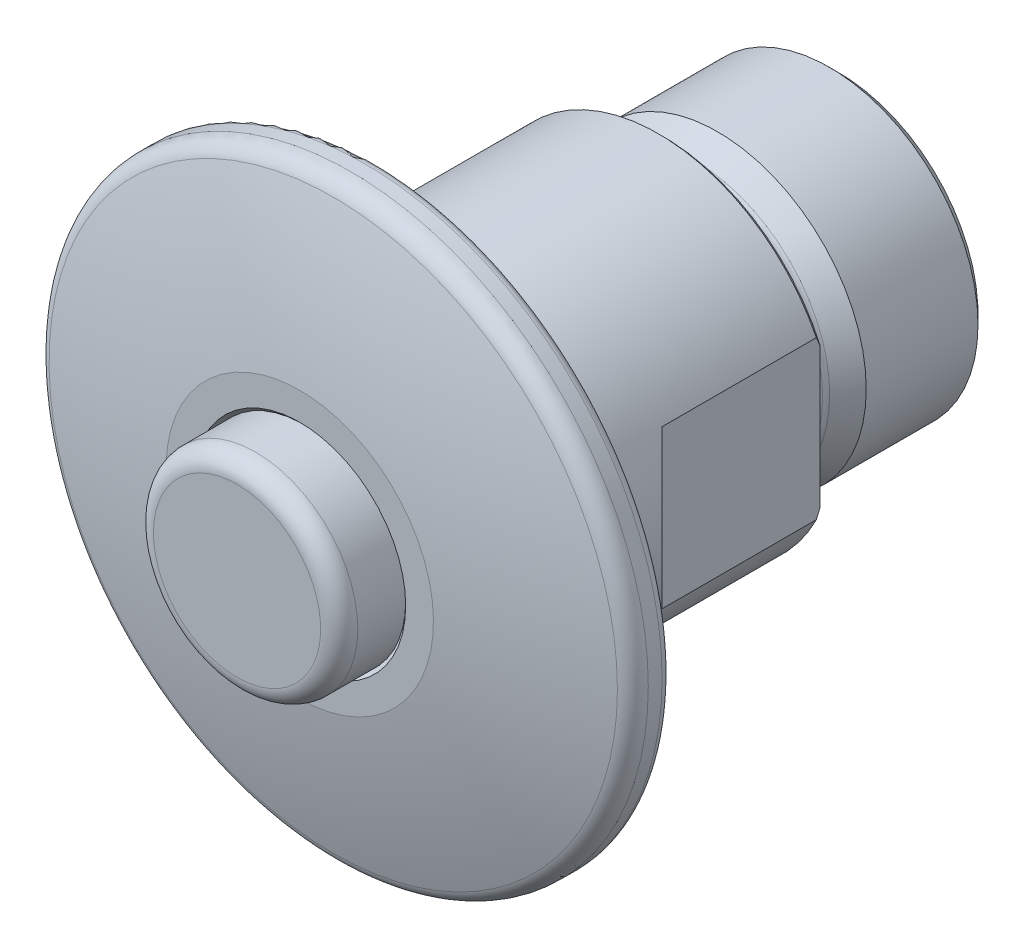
ISO-10303-21;
HEADER;
FILE_DESCRIPTION(('STEP AP214'),'2;1');
FILE_NAME('part.step','',(''),(''),'','','');
FILE_SCHEMA(('AUTOMOTIVE_DESIGN { 1 0 10303 214 1 1 1 1 }'));
ENDSEC;
DATA;
#1=APPLICATION_CONTEXT('core data for automotive mechanical design processes');
#2=APPLICATION_PROTOCOL_DEFINITION('international standard','automotive_design',2000,#1);
#3=PRODUCT_CONTEXT('',#1,'mechanical');
#4=PRODUCT('Part','Part','',(#3));
#5=PRODUCT_RELATED_PRODUCT_CATEGORY('part','',(#4));
#6=PRODUCT_DEFINITION_FORMATION('','',#4);
#7=PRODUCT_DEFINITION_CONTEXT('part definition',#1,'design');
#8=PRODUCT_DEFINITION('design','',#6,#7);
#9=PRODUCT_DEFINITION_SHAPE('','',#8);
#10=(LENGTH_UNIT() NAMED_UNIT(*) SI_UNIT(.MILLI.,.METRE.));
#11=(NAMED_UNIT(*) PLANE_ANGLE_UNIT() SI_UNIT($,.RADIAN.));
#12=(NAMED_UNIT(*) SI_UNIT($,.STERADIAN.) SOLID_ANGLE_UNIT());
#13=UNCERTAINTY_MEASURE_WITH_UNIT(LENGTH_MEASURE(1.E-05),#10,'distance_accuracy_value','');
#14=(GEOMETRIC_REPRESENTATION_CONTEXT(3) GLOBAL_UNCERTAINTY_ASSIGNED_CONTEXT((#13)) GLOBAL_UNIT_ASSIGNED_CONTEXT((#10,
#11,#12)) REPRESENTATION_CONTEXT('',''));
#15=CARTESIAN_POINT('',(0.,0.,0.));
#16=DIRECTION('',(0.,0.,1.));
#17=DIRECTION('',(1.,0.,0.));
#18=AXIS2_PLACEMENT_3D('',#15,#16,#17);
#19=CARTESIAN_POINT('',(0.,0.,0.2));
#20=DIRECTION('',(0.,0.,1.));
#21=DIRECTION('',(-1.,0.,0.));
#22=AXIS2_PLACEMENT_3D('',#19,#20,#21);
#23=CONICAL_SURFACE('',#22,9.5,0.785398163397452);
#24=CARTESIAN_POINT('',(8.5,-19.0943646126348,11.6008315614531));
#25=CARTESIAN_POINT('',(8.5,-18.8138735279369,11.3445887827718));
#26=CARTESIAN_POINT('',(8.5,-18.5329229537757,11.0888486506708));
#27=CARTESIAN_POINT('',(8.5,-17.9699706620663,10.5785232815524));
#28=CARTESIAN_POINT('',(8.5,-17.6879689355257,10.3239380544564));
#29=CARTESIAN_POINT('',(8.5,-16.8400586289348,9.56202227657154));
#30=CARTESIAN_POINT('',(8.5,-16.2723811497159,9.05665634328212));
#31=CARTESIAN_POINT('',(8.5,-15.12687872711,8.04927472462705));
#32=CARTESIAN_POINT('',(8.5,-14.5490103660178,7.54730823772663));
#33=CARTESIAN_POINT('',(8.5,-13.6760664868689,6.8016176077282));
#34=CARTESIAN_POINT('',(8.5,-13.3840789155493,6.55427818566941));
#35=CARTESIAN_POINT('',(8.5,-12.7976953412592,6.06246897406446));
#36=CARTESIAN_POINT('',(8.5,-12.5032993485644,5.81799917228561));
#37=CARTESIAN_POINT('',(8.5,-11.9575818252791,5.37015304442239));
#38=CARTESIAN_POINT('',(8.5,-11.7066635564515,5.16628561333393));
#39=CARTESIAN_POINT('',(8.5,-11.2025163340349,4.76142938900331));
#40=CARTESIAN_POINT('',(8.5,-10.9492874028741,4.56044056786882));
#41=CARTESIAN_POINT('',(8.5,-10.4400806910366,4.1618043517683));
#42=CARTESIAN_POINT('',(8.5,-10.184102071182,3.96415802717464));
#43=CARTESIAN_POINT('',(8.5,-9.66905078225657,3.57293588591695));
#44=CARTESIAN_POINT('',(8.5,-9.40997814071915,3.37936003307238));
#45=CARTESIAN_POINT('',(8.5,-8.88858958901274,2.99738076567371));
#46=CARTESIAN_POINT('',(8.5,-8.62627866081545,2.80897056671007));
#47=CARTESIAN_POINT('',(8.5,-8.09744880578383,2.4381059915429));
#48=CARTESIAN_POINT('',(8.5,-7.83092968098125,2.25565189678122));
#49=CARTESIAN_POINT('',(8.5,-7.29312649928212,1.898184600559));
#50=CARTESIAN_POINT('',(8.5,-7.02184496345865,1.72316762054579));
#51=CARTESIAN_POINT('',(8.5,-6.47360674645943,1.38229751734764));
#52=CARTESIAN_POINT('',(8.5,-6.19665085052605,1.21644313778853));
#53=CARTESIAN_POINT('',(8.5,-5.64264106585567,0.899946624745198));
#54=CARTESIAN_POINT('',(8.5,-5.36573881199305,0.749040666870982));
#55=CARTESIAN_POINT('',(8.5,-4.80475306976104,0.46103013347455));
#56=CARTESIAN_POINT('',(8.5,-4.52066889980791,0.323926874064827));
#57=CARTESIAN_POINT('',(8.5,-3.94506856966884,0.0673529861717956));
#58=CARTESIAN_POINT('',(8.5,-3.65356393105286,-0.0521432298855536));
#59=CARTESIAN_POINT('',(8.5,-3.06248782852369,-0.269307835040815));
#60=CARTESIAN_POINT('',(8.5,-2.76291865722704,-0.366982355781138));
#61=CARTESIAN_POINT('',(8.5,-2.21511843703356,-0.519247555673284));
#62=CARTESIAN_POINT('',(8.5,-1.96819636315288,-0.578519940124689));
#63=CARTESIAN_POINT('',(8.5,-1.47038918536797,-0.677205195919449));
#64=CARTESIAN_POINT('',(8.5,-1.21950464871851,-0.716620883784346));
#65=CARTESIAN_POINT('',(8.5,-0.715807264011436,-0.77357398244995));
#66=CARTESIAN_POINT('',(8.5,-0.463000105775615,-0.791160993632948));
#67=CARTESIAN_POINT('',(8.5,0.0431832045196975,-0.803656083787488));
#68=CARTESIAN_POINT('',(8.5,0.296559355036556,-0.798564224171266));
#69=CARTESIAN_POINT('',(8.5,0.801483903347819,-0.766010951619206));
#70=CARTESIAN_POINT('',(8.5,1.05303439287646,-0.738581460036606));
#71=CARTESIAN_POINT('',(8.5,1.55294571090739,-0.66283917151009));
#72=CARTESIAN_POINT('',(8.5,1.80130626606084,-0.614524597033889));
#73=CARTESIAN_POINT('',(8.5,2.29429637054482,-0.499081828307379));
#74=CARTESIAN_POINT('',(8.5,2.53891347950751,-0.431901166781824));
#75=CARTESIAN_POINT('',(8.5,3.02304633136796,-0.281360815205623));
#76=CARTESIAN_POINT('',(8.5,3.26256224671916,-0.198001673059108));
#77=CARTESIAN_POINT('',(8.5,3.80850002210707,0.00983052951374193));
#78=CARTESIAN_POINT('',(8.5,4.11308980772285,0.139094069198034));
#79=CARTESIAN_POINT('',(8.5,4.71389361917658,0.415947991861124));
#80=CARTESIAN_POINT('',(8.5,5.01010313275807,0.56354802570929));
#81=CARTESIAN_POINT('',(8.5,5.59547300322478,0.873374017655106));
#82=CARTESIAN_POINT('',(8.5,5.88461804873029,1.03562868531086));
#83=CARTESIAN_POINT('',(8.5,6.45618128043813,1.37140175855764));
#84=CARTESIAN_POINT('',(8.5,6.7386005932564,1.54491825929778));
#85=CARTESIAN_POINT('',(8.5,7.30080558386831,1.90286894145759));
#86=CARTESIAN_POINT('',(8.5,7.58052760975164,2.08740262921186));
#87=CARTESIAN_POINT('',(8.5,8.13499642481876,2.46378947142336));
#88=CARTESIAN_POINT('',(8.5,8.40974305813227,2.65564285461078));
#89=CARTESIAN_POINT('',(8.5,8.95467932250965,3.04503953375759));
#90=CARTESIAN_POINT('',(8.5,9.22487388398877,3.24257594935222));
#91=CARTESIAN_POINT('',(8.5,9.76166130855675,3.64248866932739));
#92=CARTESIAN_POINT('',(8.5,10.0282540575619,3.84486512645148));
#93=CARTESIAN_POINT('',(8.5,10.6829535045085,4.34968180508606));
#94=CARTESIAN_POINT('',(8.5,11.0692715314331,4.65444012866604));
#95=CARTESIAN_POINT('',(8.5,11.8365740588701,5.27059733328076));
#96=CARTESIAN_POINT('',(8.5,12.2175583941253,5.58199641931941));
#97=CARTESIAN_POINT('',(8.5,12.9753822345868,6.2101778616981));
#98=CARTESIAN_POINT('',(8.5,13.352219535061,6.52696287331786));
#99=CARTESIAN_POINT('',(8.5,14.1023361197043,7.16471757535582));
#100=CARTESIAN_POINT('',(8.5,14.4756153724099,7.48568730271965));
#101=CARTESIAN_POINT('',(8.5,15.2059478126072,8.11950452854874));
#102=CARTESIAN_POINT('',(8.5,15.5631045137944,8.43223289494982));
#103=CARTESIAN_POINT('',(8.5,16.2751075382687,9.06031130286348));
#104=CARTESIAN_POINT('',(8.5,16.6299538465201,9.37566136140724));
#105=CARTESIAN_POINT('',(8.5,17.3373573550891,10.0082593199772));
#106=CARTESIAN_POINT('',(8.5,17.6899163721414,10.3255051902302));
#107=CARTESIAN_POINT('',(8.5,18.3933408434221,10.9618543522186));
#108=CARTESIAN_POINT('',(8.5,18.7442063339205,11.2809576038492));
#109=CARTESIAN_POINT('',(8.5,19.0943646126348,11.6008315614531));
#110=B_SPLINE_CURVE_WITH_KNOTS('',3,(#24,#25,#26,#27,#28,#29,#30,#31,#32,#33,#34,#35,#36,#37,
#38,#39,#40,#41,#42,#43,#44,#45,#46,#47,#48,#49,#50,#51,#52,#53,#54,#55,#56,#57,#58,#59,#60,#61,
#62,#63,#64,#65,#66,#67,#68,#69,#70,#71,#72,#73,#74,#75,#76,#77,#78,#79,#80,#81,#82,#83,#84,#85,
#86,#87,#88,#89,#90,#91,#92,#93,#94,#95,#96,#97,#98,#99,#100,#101,#102,#103,#104,#105,#106,#107,
#108,#109),.UNSPECIFIED.,.F.,.F.,(4,2,2,2,2,2,2,2,2,2,2,2,2,2,2,2,2,2,2,2,2,2,2,2,2,2,2,2,2,2,2,
2,2,2,2,2,2,2,2,2,2,2,4),(0.,1.13974518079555,2.27950013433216,4.55956410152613,
6.85580270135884,8.00378756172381,9.1517675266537,10.1216454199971,11.0915139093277,
12.061687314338,13.0318520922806,14.0006748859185,14.969543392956,15.937913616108,
16.9061507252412,17.8519028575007,18.7977450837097,19.7421989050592,20.686387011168,
21.4474901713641,22.2084853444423,22.9677481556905,23.7270089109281,24.4851865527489,
25.2434287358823,26.0038008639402,26.7641472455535,27.75598981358,28.748356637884,
29.7427115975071,30.7368988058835,31.7420791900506,32.7472910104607,33.7513331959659,
34.7554071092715,36.231472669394,37.7075838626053,39.1844451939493,40.661319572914,
42.0854672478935,43.5096241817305,44.9324612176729,46.3552676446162),.UNSPECIFIED.);
#111=CARTESIAN_POINT('',(8.5,-4.24264068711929,0.2));
#112=VERTEX_POINT('',#111);
#113=CARTESIAN_POINT('',(8.5,-3.77359245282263,0.));
#114=VERTEX_POINT('',#113);
#115=EDGE_CURVE('E66',#112,#114,#110,.T.);
#116=ORIENTED_EDGE('',*,*,#115,.F.);
#117=CARTESIAN_POINT('',(0.,0.,0.2));
#118=DIRECTION('',(0.,0.,1.));
#119=DIRECTION('',(-1.,0.,0.));
#120=AXIS2_PLACEMENT_3D('',#117,#118,#119);
#121=CIRCLE('',#120,9.5);
#122=CARTESIAN_POINT('',(-8.5,-4.24264068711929,0.2));
#123=VERTEX_POINT('',#122);
#124=EDGE_CURVE('E86',#123,#112,#121,.T.);
#125=ORIENTED_EDGE('',*,*,#124,.F.);
#126=CARTESIAN_POINT('',(-8.5,19.0943646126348,11.6008315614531));
#127=CARTESIAN_POINT('',(-8.5,18.8138735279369,11.3445887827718));
#128=CARTESIAN_POINT('',(-8.5,18.5329229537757,11.0888486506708));
#129=CARTESIAN_POINT('',(-8.5,17.9699706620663,10.5785232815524));
#130=CARTESIAN_POINT('',(-8.5,17.6879689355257,10.3239380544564));
#131=CARTESIAN_POINT('',(-8.5,16.8400586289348,9.56202227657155));
#132=CARTESIAN_POINT('',(-8.5,16.2723811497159,9.05665634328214));
#133=CARTESIAN_POINT('',(-8.5,15.12687872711,8.04927472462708));
#134=CARTESIAN_POINT('',(-8.5,14.5490103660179,7.54730823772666));
#135=CARTESIAN_POINT('',(-8.5,13.676066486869,6.80161760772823));
#136=CARTESIAN_POINT('',(-8.5,13.3840789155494,6.55427818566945));
#137=CARTESIAN_POINT('',(-8.5,12.7976953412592,6.0624689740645));
#138=CARTESIAN_POINT('',(-8.5,12.5032993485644,5.81799917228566));
#139=CARTESIAN_POINT('',(-8.5,11.9575818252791,5.37015304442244));
#140=CARTESIAN_POINT('',(-8.5,11.7066635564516,5.16628561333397));
#141=CARTESIAN_POINT('',(-8.5,11.202516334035,4.76142938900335));
#142=CARTESIAN_POINT('',(-8.5,10.9492874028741,4.56044056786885));
#143=CARTESIAN_POINT('',(-8.5,10.4400806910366,4.16180435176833));
#144=CARTESIAN_POINT('',(-8.5,10.184102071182,3.96415802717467));
#145=CARTESIAN_POINT('',(-8.5,9.66905078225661,3.57293588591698));
#146=CARTESIAN_POINT('',(-8.5,9.40997814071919,3.37936003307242));
#147=CARTESIAN_POINT('',(-8.5,8.88858958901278,2.99738076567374));
#148=CARTESIAN_POINT('',(-8.5,8.6262786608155,2.80897056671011));
#149=CARTESIAN_POINT('',(-8.5,8.09744880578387,2.43810599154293));
#150=CARTESIAN_POINT('',(-8.5,7.8309296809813,2.25565189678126));
#151=CARTESIAN_POINT('',(-8.5,7.29312649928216,1.89818460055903));
#152=CARTESIAN_POINT('',(-8.5,7.0218449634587,1.72316762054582));
#153=CARTESIAN_POINT('',(-8.5,6.47360674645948,1.38229751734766));
#154=CARTESIAN_POINT('',(-8.5,6.1966508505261,1.21644313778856));
#155=CARTESIAN_POINT('',(-8.5,5.64264106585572,0.899946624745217));
#156=CARTESIAN_POINT('',(-8.5,5.3657388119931,0.749040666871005));
#157=CARTESIAN_POINT('',(-8.5,4.80475306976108,0.461030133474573));
#158=CARTESIAN_POINT('',(-8.5,4.52066889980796,0.323926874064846));
#159=CARTESIAN_POINT('',(-8.5,3.94506856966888,0.0673529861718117));
#160=CARTESIAN_POINT('',(-8.5,3.6535639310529,-0.052143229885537));
#161=CARTESIAN_POINT('',(-8.5,3.06248782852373,-0.2693078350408));
#162=CARTESIAN_POINT('',(-8.5,2.76291865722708,-0.366982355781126));
#163=CARTESIAN_POINT('',(-8.5,2.2151184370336,-0.519247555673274));
#164=CARTESIAN_POINT('',(-8.5,1.96819636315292,-0.578519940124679));
#165=CARTESIAN_POINT('',(-8.5,1.47038918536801,-0.677205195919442));
#166=CARTESIAN_POINT('',(-8.5,1.21950464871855,-0.716620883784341));
#167=CARTESIAN_POINT('',(-8.5,0.71580726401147,-0.773573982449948));
#168=CARTESIAN_POINT('',(-8.5,0.463000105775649,-0.791160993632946));
#169=CARTESIAN_POINT('',(-8.5,-0.0431832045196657,-0.803656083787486));
#170=CARTESIAN_POINT('',(-8.5,-0.296559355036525,-0.798564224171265));
#171=CARTESIAN_POINT('',(-8.5,-0.801483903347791,-0.766010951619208));
#172=CARTESIAN_POINT('',(-8.5,-1.05303439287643,-0.73858146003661));
#173=CARTESIAN_POINT('',(-8.5,-1.55294571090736,-0.662839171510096));
#174=CARTESIAN_POINT('',(-8.5,-1.80130626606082,-0.614524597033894));
#175=CARTESIAN_POINT('',(-8.5,-2.29429637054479,-0.499081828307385));
#176=CARTESIAN_POINT('',(-8.5,-2.53891347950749,-0.431901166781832));
#177=CARTESIAN_POINT('',(-8.5,-3.02304633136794,-0.281360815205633));
#178=CARTESIAN_POINT('',(-8.5,-3.26256224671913,-0.198001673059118));
#179=CARTESIAN_POINT('',(-8.5,-3.80850002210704,0.00983052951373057));
#180=CARTESIAN_POINT('',(-8.5,-4.11308980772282,0.139094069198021));
#181=CARTESIAN_POINT('',(-8.5,-4.71389361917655,0.415947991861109));
#182=CARTESIAN_POINT('',(-8.5,-5.01010313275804,0.563548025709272));
#183=CARTESIAN_POINT('',(-8.5,-5.59547300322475,0.873374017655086));
#184=CARTESIAN_POINT('',(-8.5,-5.88461804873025,1.03562868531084));
#185=CARTESIAN_POINT('',(-8.5,-6.45618128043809,1.37140175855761));
#186=CARTESIAN_POINT('',(-8.5,-6.73860059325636,1.54491825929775));
#187=CARTESIAN_POINT('',(-8.5,-7.30080558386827,1.90286894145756));
#188=CARTESIAN_POINT('',(-8.5,-7.58052760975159,2.08740262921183));
#189=CARTESIAN_POINT('',(-8.5,-8.13499642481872,2.46378947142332));
#190=CARTESIAN_POINT('',(-8.5,-8.40974305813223,2.65564285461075));
#191=CARTESIAN_POINT('',(-8.5,-8.95467932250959,3.04503953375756));
#192=CARTESIAN_POINT('',(-8.5,-9.22487388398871,3.24257594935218));
#193=CARTESIAN_POINT('',(-8.5,-9.7616613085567,3.64248866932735));
#194=CARTESIAN_POINT('',(-8.5,-10.0282540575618,3.84486512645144));
#195=CARTESIAN_POINT('',(-8.5,-10.6829535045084,4.34968180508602));
#196=CARTESIAN_POINT('',(-8.5,-11.0692715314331,4.654440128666));
#197=CARTESIAN_POINT('',(-8.5,-11.83657405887,5.27059733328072));
#198=CARTESIAN_POINT('',(-8.5,-12.2175583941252,5.58199641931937));
#199=CARTESIAN_POINT('',(-8.5,-12.9753822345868,6.21017786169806));
#200=CARTESIAN_POINT('',(-8.5,-13.352219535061,6.52696287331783));
#201=CARTESIAN_POINT('',(-8.5,-14.1023361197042,7.16471757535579));
#202=CARTESIAN_POINT('',(-8.5,-14.4756153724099,7.48568730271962));
#203=CARTESIAN_POINT('',(-8.5,-15.2059478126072,8.11950452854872));
#204=CARTESIAN_POINT('',(-8.5,-15.5631045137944,8.4322328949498));
#205=CARTESIAN_POINT('',(-8.5,-16.2751075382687,9.06031130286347));
#206=CARTESIAN_POINT('',(-8.5,-16.6299538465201,9.37566136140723));
#207=CARTESIAN_POINT('',(-8.5,-17.3373573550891,10.0082593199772));
#208=CARTESIAN_POINT('',(-8.5,-17.6899163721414,10.3255051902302));
#209=CARTESIAN_POINT('',(-8.5,-18.3933408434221,10.9618543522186));
#210=CARTESIAN_POINT('',(-8.5,-18.7442063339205,11.2809576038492));
#211=CARTESIAN_POINT('',(-8.5,-19.0943646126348,11.6008315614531));
#212=B_SPLINE_CURVE_WITH_KNOTS('',3,(#126,#127,#128,#129,#130,#131,#132,#133,#134,#135,#136,
#137,#138,#139,#140,#141,#142,#143,#144,#145,#146,#147,#148,#149,#150,#151,#152,#153,#154,#155,
#156,#157,#158,#159,#160,#161,#162,#163,#164,#165,#166,#167,#168,#169,#170,#171,#172,#173,#174,
#175,#176,#177,#178,#179,#180,#181,#182,#183,#184,#185,#186,#187,#188,#189,#190,#191,#192,#193,
#194,#195,#196,#197,#198,#199,#200,#201,#202,#203,#204,#205,#206,#207,#208,#209,#210,#211),
.UNSPECIFIED.,.F.,.F.,(4,2,2,2,2,2,2,2,2,2,2,2,2,2,2,2,2,2,2,2,2,2,2,2,2,2,2,2,2,2,2,2,2,2,2,2,
2,2,2,2,2,2,4),(0.,1.13974518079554,2.27950013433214,4.55956410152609,6.85580270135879,
8.00378756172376,9.15176752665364,10.121645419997,11.0915139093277,12.0616873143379,
13.0318520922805,14.0006748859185,14.9695433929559,15.9379136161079,16.9061507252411,
17.8519028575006,18.7977450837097,19.7421989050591,20.686387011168,21.4474901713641,
22.2084853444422,22.9677481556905,23.7270089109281,24.4851865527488,25.2434287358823,
26.0038008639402,26.7641472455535,27.75598981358,28.7483566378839,29.7427115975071,
30.7368988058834,31.7420791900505,32.7472910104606,33.7513331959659,34.7554071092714,
36.2314726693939,37.7075838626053,39.1844451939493,40.6613195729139,42.0854672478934,
43.5096241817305,44.9324612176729,46.3552676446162),.UNSPECIFIED.);
#213=CARTESIAN_POINT('',(-8.5,-3.77359245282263,0.));
#214=VERTEX_POINT('',#213);
#215=EDGE_CURVE('E85',#214,#123,#212,.T.);
#216=ORIENTED_EDGE('',*,*,#215,.F.);
#217=CARTESIAN_POINT('',(0.,0.,0.));
#218=DIRECTION('',(0.,0.,1.));
#219=DIRECTION('',(-1.,0.,0.));
#220=AXIS2_PLACEMENT_3D('',#217,#218,#219);
#221=CIRCLE('',#220,9.3);
#222=EDGE_CURVE('E36',#114,#214,#221,.F.);
#223=ORIENTED_EDGE('',*,*,#222,.F.);
#224=EDGE_LOOP('',(#116,#125,#216,#223));
#225=FACE_BOUND('',#224,.T.);
#226=ADVANCED_FACE('F14',(#225),#23,.T.);
#227=CARTESIAN_POINT('',(0.,0.,25.9933488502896));
#228=DIRECTION('',(0.,0.,1.));
#229=DIRECTION('',(-1.,0.,0.));
#230=AXIS2_PLACEMENT_3D('',#227,#228,#229);
#231=CYLINDRICAL_SURFACE('',#230,8.);
#232=CARTESIAN_POINT('',(0.,0.,-9.));
#233=DIRECTION('',(0.,0.,1.));
#234=DIRECTION('',(-1.,0.,0.));
#235=AXIS2_PLACEMENT_3D('',#232,#233,#234);
#236=CIRCLE('',#235,8.);
#237=CARTESIAN_POINT('',(-8.,0.,-9.));
#238=VERTEX_POINT('',#237);
#239=EDGE_CURVE('E290',#238,#238,#236,.T.);
#240=ORIENTED_EDGE('',*,*,#239,.T.);
#241=EDGE_LOOP('',(#240));
#242=FACE_BOUND('',#241,.T.);
#243=CARTESIAN_POINT('',(0.,0.,-2.98564064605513));
#244=DIRECTION('',(0.,0.,-1.));
#245=DIRECTION('',(1.,0.,0.));
#246=AXIS2_PLACEMENT_3D('',#243,#244,#245);
#247=CIRCLE('',#246,8.);
#248=CARTESIAN_POINT('',(8.,0.,-2.98564064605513));
#249=VERTEX_POINT('',#248);
#250=EDGE_CURVE('E272',#249,#249,#247,.T.);
#251=ORIENTED_EDGE('',*,*,#250,.T.);
#252=EDGE_LOOP('',(#251));
#253=FACE_BOUND('',#252,.T.);
#254=ADVANCED_FACE('F143',(#242,#253),#231,.T.);
#255=CARTESIAN_POINT('',(0.,-8.,0.));
#256=DIRECTION('',(0.,0.,1.));
#257=DIRECTION('',(-1.,0.,0.));
#258=AXIS2_PLACEMENT_3D('',#255,#256,#257);
#259=PLANE('',#258);
#260=CARTESIAN_POINT('',(0.,0.,0.));
#261=DIRECTION('',(0.,0.,1.));
#262=DIRECTION('',(-1.,0.,0.));
#263=AXIS2_PLACEMENT_3D('',#260,#261,#262);
#264=CIRCLE('',#263,7.8);
#265=CARTESIAN_POINT('',(-7.8,0.,0.));
#266=VERTEX_POINT('',#265);
#267=EDGE_CURVE('E240',#266,#266,#264,.T.);
#268=ORIENTED_EDGE('',*,*,#267,.T.);
#269=EDGE_LOOP('',(#268));
#270=FACE_BOUND('',#269,.T.);
#271=CARTESIAN_POINT('',(-8.5,3.77359245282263,0.));
#272=VERTEX_POINT('',#271);
#273=CARTESIAN_POINT('',(8.5,3.77359245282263,0.));
#274=VERTEX_POINT('',#273);
#275=EDGE_CURVE('E80',#272,#274,#221,.F.);
#276=ORIENTED_EDGE('',*,*,#275,.T.);
#277=DIRECTION('',(0.,-1.,0.));
#278=VECTOR('',#277,1.);
#279=CARTESIAN_POINT('',(8.5,16.,0.));
#280=LINE('',#279,#278);
#281=EDGE_CURVE('E29',#274,#114,#280,.T.);
#282=ORIENTED_EDGE('',*,*,#281,.T.);
#283=ORIENTED_EDGE('',*,*,#222,.T.);
#284=DIRECTION('',(0.,-1.,0.));
#285=VECTOR('',#284,1.);
#286=CARTESIAN_POINT('',(-8.5,16.,0.));
#287=LINE('',#286,#285);
#288=EDGE_CURVE('E262',#272,#214,#287,.T.);
#289=ORIENTED_EDGE('',*,*,#288,.F.);
#290=EDGE_LOOP('',(#276,#282,#283,#289));
#291=FACE_BOUND('',#290,.T.);
#292=ADVANCED_FACE('F78',(#270,#291),#259,.F.);
#293=CARTESIAN_POINT('',(0.,0.,25.9933488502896));
#294=DIRECTION('',(0.,0.,1.));
#295=DIRECTION('',(-1.,0.,0.));
#296=AXIS2_PLACEMENT_3D('',#293,#294,#295);
#297=CYLINDRICAL_SURFACE('',#296,9.5);
#298=CARTESIAN_POINT('',(0.,0.,12.5));
#299=DIRECTION('',(0.,0.,1.));
#300=DIRECTION('',(-1.,0.,0.));
#301=AXIS2_PLACEMENT_3D('',#298,#299,#300);
#302=CIRCLE('',#301,9.5);
#303=CARTESIAN_POINT('',(-9.5,0.,12.5));
#304=VERTEX_POINT('',#303);
#305=EDGE_CURVE('E222',#304,#304,#302,.F.);
#306=ORIENTED_EDGE('',*,*,#305,.T.);
#307=EDGE_LOOP('',(#306));
#308=FACE_BOUND('',#307,.T.);
#309=CARTESIAN_POINT('',(0.,0.,0.));
#310=DIRECTION('',(-0.707106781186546,0.,0.707106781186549));
#311=DIRECTION('',(0.707106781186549,0.,0.707106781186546));
#312=AXIS2_PLACEMENT_3D('',#309,#310,#311);
#313=ELLIPSE('',#312,13.4350288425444,9.5);
#314=CARTESIAN_POINT('',(8.5,-4.24264068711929,8.5));
#315=VERTEX_POINT('',#314);
#316=CARTESIAN_POINT('',(8.5,4.24264068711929,8.5));
#317=VERTEX_POINT('',#316);
#318=EDGE_CURVE('E74',#315,#317,#313,.T.);
#319=ORIENTED_EDGE('',*,*,#318,.T.);
#320=DIRECTION('',(0.,0.,1.));
#321=VECTOR('',#320,1.);
#322=CARTESIAN_POINT('',(8.5,4.24264068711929,25.9933488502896));
#323=LINE('',#322,#321);
#324=CARTESIAN_POINT('',(8.5,4.24264068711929,0.2));
#325=VERTEX_POINT('',#324);
#326=EDGE_CURVE('E81',#317,#325,#323,.F.);
#327=ORIENTED_EDGE('',*,*,#326,.T.);
#328=CARTESIAN_POINT('',(-8.5,4.24264068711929,0.2));
#329=VERTEX_POINT('',#328);
#330=EDGE_CURVE('E89',#325,#329,#121,.T.);
#331=ORIENTED_EDGE('',*,*,#330,.T.);
#332=DIRECTION('',(0.,0.,1.));
#333=VECTOR('',#332,1.);
#334=CARTESIAN_POINT('',(-8.5,4.24264068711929,25.9933488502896));
#335=LINE('',#334,#333);
#336=CARTESIAN_POINT('',(-8.5,4.24264068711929,8.5));
#337=VERTEX_POINT('',#336);
#338=EDGE_CURVE('E269',#329,#337,#335,.T.);
#339=ORIENTED_EDGE('',*,*,#338,.T.);
#340=CARTESIAN_POINT('',(0.,0.,0.));
#341=DIRECTION('',(0.707106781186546,0.,0.707106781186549));
#342=DIRECTION('',(-0.707106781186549,0.,0.707106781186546));
#343=AXIS2_PLACEMENT_3D('',#340,#341,#342);
#344=ELLIPSE('',#343,13.4350288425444,9.5);
#345=CARTESIAN_POINT('',(-8.5,-4.24264068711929,8.5));
#346=VERTEX_POINT('',#345);
#347=EDGE_CURVE('E106',#337,#346,#344,.T.);
#348=ORIENTED_EDGE('',*,*,#347,.T.);
#349=DIRECTION('',(0.,0.,1.));
#350=VECTOR('',#349,1.);
#351=CARTESIAN_POINT('',(-8.5,-4.24264068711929,25.9933488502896));
#352=LINE('',#351,#350);
#353=EDGE_CURVE('E264',#346,#123,#352,.F.);
#354=ORIENTED_EDGE('',*,*,#353,.T.);
#355=ORIENTED_EDGE('',*,*,#124,.T.);
#356=DIRECTION('',(0.,0.,1.));
#357=VECTOR('',#356,1.);
#358=CARTESIAN_POINT('',(8.5,-4.24264068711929,25.9933488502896));
#359=LINE('',#358,#357);
#360=EDGE_CURVE('E70',#112,#315,#359,.T.);
#361=ORIENTED_EDGE('',*,*,#360,.T.);
#362=EDGE_LOOP('',(#319,#327,#331,#339,#348,#354,#355,#361));
#363=FACE_BOUND('',#362,.T.);
#364=ADVANCED_FACE('F165',(#308,#363),#297,.T.);
#365=CARTESIAN_POINT('',(0.,-16.,15.5));
#366=DIRECTION('',(0.,0.,1.));
#367=DIRECTION('',(-1.,0.,0.));
#368=AXIS2_PLACEMENT_3D('',#365,#366,#367);
#369=PLANE('',#368);
#370=CARTESIAN_POINT('',(0.,0.,15.5));
#371=DIRECTION('',(0.,0.,1.));
#372=DIRECTION('',(-1.,0.,0.));
#373=AXIS2_PLACEMENT_3D('',#370,#371,#372);
#374=CIRCLE('',#373,15.5);
#375=CARTESIAN_POINT('',(-15.5,0.,15.5));
#376=VERTEX_POINT('',#375);
#377=EDGE_CURVE('E228',#376,#376,#374,.F.);
#378=ORIENTED_EDGE('',*,*,#377,.T.);
#379=EDGE_LOOP('',(#378));
#380=FACE_BOUND('',#379,.T.);
#381=CARTESIAN_POINT('',(0.,0.,15.5));
#382=DIRECTION('',(0.,0.,1.));
#383=DIRECTION('',(-1.,0.,0.));
#384=AXIS2_PLACEMENT_3D('',#381,#382,#383);
#385=CIRCLE('',#384,12.5);
#386=CARTESIAN_POINT('',(-12.5,0.,15.5));
#387=VERTEX_POINT('',#386);
#388=EDGE_CURVE('E219',#387,#387,#385,.T.);
#389=ORIENTED_EDGE('',*,*,#388,.T.);
#390=EDGE_LOOP('',(#389));
#391=FACE_BOUND('',#390,.T.);
#392=ADVANCED_FACE('F161',(#380,#391),#369,.F.);
#393=CARTESIAN_POINT('',(0.,0.,25.9933488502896));
#394=DIRECTION('',(0.,0.,1.));
#395=DIRECTION('',(-1.,0.,0.));
#396=AXIS2_PLACEMENT_3D('',#393,#394,#395);
#397=CYLINDRICAL_SURFACE('',#396,16.);
#398=CARTESIAN_POINT('',(0.,0.,16.));
#399=DIRECTION('',(0.,0.,1.));
#400=DIRECTION('',(-1.,0.,0.));
#401=AXIS2_PLACEMENT_3D('',#398,#399,#400);
#402=CIRCLE('',#401,16.);
#403=CARTESIAN_POINT('',(-16.,0.,16.));
#404=VERTEX_POINT('',#403);
#405=EDGE_CURVE('E225',#404,#404,#402,.T.);
#406=ORIENTED_EDGE('',*,*,#405,.T.);
#407=EDGE_LOOP('',(#406));
#408=FACE_BOUND('',#407,.T.);
#409=CARTESIAN_POINT('',(0.,0.,16.7442304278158));
#410=DIRECTION('',(0.,0.,-1.));
#411=DIRECTION('',(1.,0.,0.));
#412=AXIS2_PLACEMENT_3D('',#409,#410,#411);
#413=CIRCLE('',#412,16.);
#414=CARTESIAN_POINT('',(16.,0.,16.7442304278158));
#415=VERTEX_POINT('',#414);
#416=EDGE_CURVE('E95',#415,#415,#413,.T.);
#417=ORIENTED_EDGE('',*,*,#416,.T.);
#418=EDGE_LOOP('',(#417));
#419=FACE_BOUND('',#418,.T.);
#420=ADVANCED_FACE('F157',(#408,#419),#397,.T.);
#421=CARTESIAN_POINT('',(0.,0.,-32.));
#422=DIRECTION('',(0.,0.,1.));
#423=DIRECTION('',(0.,-1.,0.));
#424=AXIS2_PLACEMENT_3D('',#421,#422,#423);
#425=SPHERICAL_SURFACE('',#424,52.);
#426=CARTESIAN_POINT('',(0.,0.,17.6999996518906));
#427=DIRECTION('',(0.,0.,-1.));
#428=DIRECTION('',(1.,0.,0.));
#429=AXIS2_PLACEMENT_3D('',#426,#427,#428);
#430=CIRCLE('',#429,15.2941176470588);
#431=CARTESIAN_POINT('',(0.,-15.2941176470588,17.6999996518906));
#432=VERTEX_POINT('',#431);
#433=EDGE_CURVE('E88',#432,#432,#430,.F.);
#434=CARTESIAN_POINT('',(0.,0.,19.5));
#435=DIRECTION('',(0.,0.,1.));
#436=DIRECTION('',(-1.,0.,0.));
#437=AXIS2_PLACEMENT_3D('',#434,#435,#436);
#438=CIRCLE('',#437,7.1937472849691);
#439=CARTESIAN_POINT('',(0.,-7.19374728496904,19.5));
#440=VERTEX_POINT('',#439);
#441=EDGE_CURVE('E281',#440,#440,#438,.T.);
#442=CARTESIAN_POINT('',(0.,-15.2941176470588,17.6999996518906));
#443=CARTESIAN_POINT('',(0.,-15.2114159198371,17.7254493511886));
#444=CARTESIAN_POINT('',(0.,-15.1286506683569,17.7506926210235));
#445=CARTESIAN_POINT('',(0.,-14.9629951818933,17.8007656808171));
#446=CARTESIAN_POINT('',(0.,-14.88010494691,17.8255954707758));
#447=CARTESIAN_POINT('',(0.,-14.714201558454,17.8748409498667));
#448=CARTESIAN_POINT('',(0.,-14.6311884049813,17.899256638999));
#449=CARTESIAN_POINT('',(0.,-14.4650412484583,17.9476733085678));
#450=CARTESIAN_POINT('',(0.,-14.3819072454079,17.9716742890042));
#451=CARTESIAN_POINT('',(0.,-14.2155204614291,18.0192609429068));
#452=CARTESIAN_POINT('',(0.,-14.1322676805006,18.042846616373));
#453=CARTESIAN_POINT('',(0.,-13.9656454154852,18.0896020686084));
#454=CARTESIAN_POINT('',(0.,-13.8822759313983,18.1127718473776));
#455=CARTESIAN_POINT('',(0.,-13.7154223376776,18.1586949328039));
#456=CARTESIAN_POINT('',(0.,-13.631938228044,18.1814482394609));
#457=CARTESIAN_POINT('',(0.,-13.4648574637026,18.2265378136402));
#458=CARTESIAN_POINT('',(0.,-13.3812608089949,18.2488740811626));
#459=CARTESIAN_POINT('',(0.,-13.2139570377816,18.2931290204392));
#460=CARTESIAN_POINT('',(0.,-13.1302499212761,18.3150476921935));
#461=CARTESIAN_POINT('',(0.,-12.9627273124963,18.3584668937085));
#462=CARTESIAN_POINT('',(0.,-12.8789118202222,18.3799674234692));
#463=CARTESIAN_POINT('',(0.,-12.7111745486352,18.4225498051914));
#464=CARTESIAN_POINT('',(0.,-12.6272527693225,18.4436316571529));
#465=CARTESIAN_POINT('',(0.,-12.459305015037,18.4853761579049));
#466=CARTESIAN_POINT('',(0.,-12.3752790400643,18.5060388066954));
#467=CARTESIAN_POINT('',(0.,-12.2071249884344,18.5469443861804));
#468=CARTESIAN_POINT('',(0.,-12.1229969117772,18.567187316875));
#469=CARTESIAN_POINT('',(0.,-11.9546407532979,18.6072529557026));
#470=CARTESIAN_POINT('',(0.,-11.8704126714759,18.6270756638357));
#471=CARTESIAN_POINT('',(0.,-11.7018586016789,18.6663003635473));
#472=CARTESIAN_POINT('',(0.,-11.6175326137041,18.6857023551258));
#473=CARTESIAN_POINT('',(0.,-11.4487848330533,18.7240851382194));
#474=CARTESIAN_POINT('',(0.,-11.3643630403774,18.7430659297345));
#475=CARTESIAN_POINT('',(0.,-11.195425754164,18.7806058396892));
#476=CARTESIAN_POINT('',(0.,-11.1109102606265,18.7991649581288));
#477=CARTESIAN_POINT('',(0.,-10.9417876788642,18.8358610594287));
#478=CARTESIAN_POINT('',(0.,-10.8571805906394,18.8539980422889));
#479=CARTESIAN_POINT('',(0.,-10.6878769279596,18.889849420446));
#480=CARTESIAN_POINT('',(0.,-10.6031803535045,18.9075638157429));
#481=CARTESIAN_POINT('',(0.,-10.4336998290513,18.9425695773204));
#482=CARTESIAN_POINT('',(0.,-10.3489158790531,18.9598609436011));
#483=CARTESIAN_POINT('',(0.,-10.179262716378,18.9940202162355));
#484=CARTESIAN_POINT('',(0.,-10.0943935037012,19.0108881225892));
#485=CARTESIAN_POINT('',(0.,-9.92457193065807,19.0442000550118));
#486=CARTESIAN_POINT('',(0.,-9.83961957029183,19.0606440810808));
#487=CARTESIAN_POINT('',(0.,-9.66963381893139,19.0931078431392));
#488=CARTESIAN_POINT('',(0.,-9.58460042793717,19.1091275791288));
#489=CARTESIAN_POINT('',(0.,-9.4144547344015,19.1407423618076));
#490=CARTESIAN_POINT('',(0.,-9.32934243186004,19.1563374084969));
#491=CARTESIAN_POINT('',(0.,-9.15904103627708,19.1871024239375));
#492=CARTESIAN_POINT('',(0.,-9.07385194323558,19.2022723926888));
#493=CARTESIAN_POINT('',(0.,-8.90339908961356,19.2321868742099));
#494=CARTESIAN_POINT('',(0.,-8.81813532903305,19.2469313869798));
#495=CARTESIAN_POINT('',(0.,-8.64753526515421,19.2759945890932));
#496=CARTESIAN_POINT('',(0.,-8.56219896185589,19.2903132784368));
#497=CARTESIAN_POINT('',(0.,-8.39145593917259,19.3185244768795));
#498=CARTESIAN_POINT('',(0.,-8.30604921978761,19.3324169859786));
#499=CARTESIAN_POINT('',(0.,-8.13516749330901,19.3597754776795));
#500=CARTESIAN_POINT('',(0.,-8.04969248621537,19.3732414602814));
#501=CARTESIAN_POINT('',(0.,-7.87867631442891,19.3997465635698));
#502=CARTESIAN_POINT('',(0.,-7.79313514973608,19.4127856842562));
#503=CARTESIAN_POINT('',(0.,-7.62198879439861,19.438436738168));
#504=CARTESIAN_POINT('',(0.,-7.53638360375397,19.4510486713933));
#505=CARTESIAN_POINT('',(0.,-7.36511133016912,19.4758450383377));
#506=CARTESIAN_POINT('',(0.,-7.27944424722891,19.4880294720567));
#507=CARTESIAN_POINT('',(0.,-7.19374728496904,19.5));
#508=B_SPLINE_CURVE_WITH_KNOTS('',3,(#442,#443,#444,#445,#446,#447,#448,#449,#450,#451,#452,
#453,#454,#455,#456,#457,#458,#459,#460,#461,#462,#463,#464,#465,#466,#467,#468,#469,#470,#471,
#472,#473,#474,#475,#476,#477,#478,#479,#480,#481,#482,#483,#484,#485,#486,#487,#488,#489,#490,
#491,#492,#493,#494,#495,#496,#497,#498,#499,#500,#501,#502,#503,#504,#505,#506,#507),
.UNSPECIFIED.,.F.,.F.,(4,2,2,2,2,2,2,2,2,2,2,2,2,2,2,2,2,2,2,2,2,2,2,2,2,2,2,2,2,2,2,2,4),(0.,
0.259586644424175,0.519173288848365,0.778759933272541,1.03834657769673,1.2979332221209,
1.55751986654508,1.81710651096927,2.07669315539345,2.33627979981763,2.59586644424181,
2.85545308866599,3.11503973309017,3.37462637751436,3.63421302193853,3.89379966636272,
4.1533863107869,4.41297295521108,4.67255959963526,4.93214624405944,5.19173288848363,
5.4513195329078,5.71090617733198,5.97049282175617,6.23007946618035,6.48966611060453,
6.74925275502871,7.00883939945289,7.26842604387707,7.52801268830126,7.78759933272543,
8.04718597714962,8.3067726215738),.UNSPECIFIED.);
#509=EDGE_CURVE('BSEAM153',#432,#440,#508,.T.);
#510=ORIENTED_EDGE('',*,*,#433,.T.);
#511=ORIENTED_EDGE('',*,*,#441,.F.);
#512=ORIENTED_EDGE('',*,*,#509,.T.);
#513=ORIENTED_EDGE('',*,*,#509,.F.);
#514=EDGE_LOOP('',(#510,#512,#511,#513));
#515=FACE_BOUND('',#514,.T.);
#516=ADVANCED_FACE('F153',(#515),#425,.T.);
#517=CARTESIAN_POINT('',(0.,0.,19.5));
#518=DIRECTION('',(0.,0.,-1.));
#519=DIRECTION('',(1.,0.,0.));
#520=AXIS2_PLACEMENT_3D('',#517,#518,#519);
#521=PLANE('',#520);
#522=CARTESIAN_POINT('',(0.,0.,19.5));
#523=DIRECTION('',(0.,0.,-1.));
#524=DIRECTION('',(1.,0.,0.));
#525=AXIS2_PLACEMENT_3D('',#522,#523,#524);
#526=CIRCLE('',#525,5.7);
#527=CARTESIAN_POINT('',(5.7,0.,19.5));
#528=VERTEX_POINT('',#527);
#529=EDGE_CURVE('E296',#528,#528,#526,.T.);
#530=ORIENTED_EDGE('',*,*,#529,.T.);
#531=EDGE_LOOP('',(#530));
#532=FACE_BOUND('',#531,.T.);
#533=ORIENTED_EDGE('',*,*,#441,.T.);
#534=EDGE_LOOP('',(#533));
#535=FACE_BOUND('',#534,.T.);
#536=ADVANCED_FACE('F149',(#532,#535),#521,.F.);
#537=CARTESIAN_POINT('',(0.,-8.,-9.5));
#538=DIRECTION('',(0.,0.,1.));
#539=DIRECTION('',(-1.,0.,0.));
#540=AXIS2_PLACEMENT_3D('',#537,#538,#539);
#541=PLANE('',#540);
#542=CARTESIAN_POINT('',(0.,0.,-9.5));
#543=DIRECTION('',(0.,0.,1.));
#544=DIRECTION('',(-1.,0.,0.));
#545=AXIS2_PLACEMENT_3D('',#542,#543,#544);
#546=CIRCLE('',#545,7.5);
#547=CARTESIAN_POINT('',(-7.5,0.,-9.5));
#548=VERTEX_POINT('',#547);
#549=EDGE_CURVE('E293',#548,#548,#546,.F.);
#550=ORIENTED_EDGE('',*,*,#549,.T.);
#551=EDGE_LOOP('',(#550));
#552=FACE_BOUND('',#551,.T.);
#553=CARTESIAN_POINT('',(0.,0.,-9.5));
#554=DIRECTION('',(0.,0.,1.));
#555=DIRECTION('',(-1.,0.,0.));
#556=AXIS2_PLACEMENT_3D('',#553,#554,#555);
#557=CIRCLE('',#556,3.5);
#558=CARTESIAN_POINT('',(-3.5,0.,-9.5));
#559=VERTEX_POINT('',#558);
#560=EDGE_CURVE('E287',#559,#559,#557,.T.);
#561=ORIENTED_EDGE('',*,*,#560,.T.);
#562=EDGE_LOOP('',(#561));
#563=FACE_BOUND('',#562,.T.);
#564=ADVANCED_FACE('F141',(#552,#563),#541,.F.);
#565=CARTESIAN_POINT('',(0.,0.,-8.5));
#566=DIRECTION('',(0.,0.,1.));
#567=DIRECTION('',(-1.,0.,0.));
#568=AXIS2_PLACEMENT_3D('',#565,#566,#567);
#569=CONICAL_SURFACE('',#568,3.85,0.34906585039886);
#570=CARTESIAN_POINT('',(0.,0.,-7.83132896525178));
#571=DIRECTION('',(0.,0.,-1.));
#572=DIRECTION('',(1.,0.,0.));
#573=AXIS2_PLACEMENT_3D('',#570,#571,#572);
#574=CIRCLE('',#573,4.09337635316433);
#575=CARTESIAN_POINT('',(4.09337635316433,0.,-7.83132896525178));
#576=VERTEX_POINT('',#575);
#577=EDGE_CURVE('E243',#576,#576,#574,.T.);
#578=ORIENTED_EDGE('',*,*,#577,.F.);
#579=EDGE_LOOP('',(#578));
#580=FACE_BOUND('',#579,.T.);
#581=CARTESIAN_POINT('',(0.,0.,-8.5));
#582=DIRECTION('',(0.,0.,-1.));
#583=DIRECTION('',(1.,0.,0.));
#584=AXIS2_PLACEMENT_3D('',#581,#582,#583);
#585=CIRCLE('',#584,3.85);
#586=CARTESIAN_POINT('',(3.85,0.,-8.5));
#587=VERTEX_POINT('',#586);
#588=EDGE_CURVE('E278',#587,#587,#585,.T.);
#589=ORIENTED_EDGE('',*,*,#588,.T.);
#590=EDGE_LOOP('',(#589));
#591=FACE_BOUND('',#590,.T.);
#592=ADVANCED_FACE('F137',(#580,#591),#569,.F.);
#593=CARTESIAN_POINT('',(0.,-3.85,-8.5));
#594=DIRECTION('',(0.,0.,-1.));
#595=DIRECTION('',(1.,0.,0.));
#596=AXIS2_PLACEMENT_3D('',#593,#594,#595);
#597=PLANE('',#596);
#598=ORIENTED_EDGE('',*,*,#588,.F.);
#599=EDGE_LOOP('',(#598));
#600=FACE_BOUND('',#599,.T.);
#601=CARTESIAN_POINT('',(0.,0.,-8.5));
#602=DIRECTION('',(0.,0.,-1.));
#603=DIRECTION('',(1.,0.,0.));
#604=AXIS2_PLACEMENT_3D('',#601,#602,#603);
#605=CIRCLE('',#604,3.);
#606=CARTESIAN_POINT('',(3.,0.,-8.5));
#607=VERTEX_POINT('',#606);
#608=EDGE_CURVE('E275',#607,#607,#605,.T.);
#609=ORIENTED_EDGE('',*,*,#608,.T.);
#610=EDGE_LOOP('',(#609));
#611=FACE_BOUND('',#610,.T.);
#612=ADVANCED_FACE('F133',(#600,#611),#597,.F.);
#613=CARTESIAN_POINT('',(0.,0.,-3.5));
#614=DIRECTION('',(0.,0.,-1.));
#615=DIRECTION('',(1.,0.,0.));
#616=AXIS2_PLACEMENT_3D('',#613,#614,#615);
#617=CYLINDRICAL_SURFACE('',#616,3.);
#618=CARTESIAN_POINT('',(0.,0.,-9.));
#619=DIRECTION('',(0.,0.,1.));
#620=DIRECTION('',(-1.,0.,0.));
#621=AXIS2_PLACEMENT_3D('',#618,#619,#620);
#622=CIRCLE('',#621,3.);
#623=CARTESIAN_POINT('',(-3.,0.,-9.));
#624=VERTEX_POINT('',#623);
#625=EDGE_CURVE('E284',#624,#624,#622,.F.);
#626=ORIENTED_EDGE('',*,*,#625,.T.);
#627=EDGE_LOOP('',(#626));
#628=FACE_BOUND('',#627,.T.);
#629=ORIENTED_EDGE('',*,*,#608,.F.);
#630=EDGE_LOOP('',(#629));
#631=FACE_BOUND('',#630,.T.);
#632=ADVANCED_FACE('F129',(#628,#631),#617,.F.);
#633=CARTESIAN_POINT('',(0.,0.,-9.));
#634=DIRECTION('',(0.,0.,-1.));
#635=DIRECTION('',(1.,0.,0.));
#636=AXIS2_PLACEMENT_3D('',#633,#634,#635);
#637=CONICAL_SURFACE('',#636,3.,0.785398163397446);
#638=ORIENTED_EDGE('',*,*,#560,.F.);
#639=EDGE_LOOP('',(#638));
#640=FACE_BOUND('',#639,.T.);
#641=ORIENTED_EDGE('',*,*,#625,.F.);
#642=EDGE_LOOP('',(#641));
#643=FACE_BOUND('',#642,.T.);
#644=ADVANCED_FACE('F132',(#640,#643),#637,.F.);
#645=CARTESIAN_POINT('',(0.,0.,-9.));
#646=DIRECTION('',(0.,0.,1.));
#647=DIRECTION('',(-1.,0.,0.));
#648=AXIS2_PLACEMENT_3D('',#645,#646,#647);
#649=CONICAL_SURFACE('',#648,8.,0.785398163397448);
#650=ORIENTED_EDGE('',*,*,#549,.F.);
#651=EDGE_LOOP('',(#650));
#652=FACE_BOUND('',#651,.T.);
#653=ORIENTED_EDGE('',*,*,#239,.F.);
#654=EDGE_LOOP('',(#653));
#655=FACE_BOUND('',#654,.T.);
#656=ADVANCED_FACE('F175',(#652,#655),#649,.T.);
#657=CARTESIAN_POINT('',(0.,0.,19.5));
#658=DIRECTION('',(0.,0.,1.));
#659=DIRECTION('',(-1.,0.,0.));
#660=AXIS2_PLACEMENT_3D('',#657,#658,#659);
#661=CONICAL_SURFACE('',#660,5.7,0.785398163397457);
#662=CARTESIAN_POINT('',(0.,0.,19.3));
#663=DIRECTION('',(0.,0.,-1.));
#664=DIRECTION('',(1.,0.,0.));
#665=AXIS2_PLACEMENT_3D('',#662,#663,#664);
#666=CIRCLE('',#665,5.5);
#667=CARTESIAN_POINT('',(5.5,0.,19.3));
#668=VERTEX_POINT('',#667);
#669=EDGE_CURVE('E298',#668,#668,#666,.F.);
#670=ORIENTED_EDGE('',*,*,#669,.F.);
#671=EDGE_LOOP('',(#670));
#672=FACE_BOUND('',#671,.T.);
#673=ORIENTED_EDGE('',*,*,#529,.F.);
#674=EDGE_LOOP('',(#673));
#675=FACE_BOUND('',#674,.T.);
#676=ADVANCED_FACE('F178',(#672,#675),#661,.F.);
#677=EDGE_CURVE('E75',#274,#325,#110,.T.);
#678=ORIENTED_EDGE('',*,*,#677,.F.);
#679=ORIENTED_EDGE('',*,*,#275,.F.);
#680=EDGE_CURVE('E105',#329,#272,#212,.T.);
#681=ORIENTED_EDGE('',*,*,#680,.F.);
#682=ORIENTED_EDGE('',*,*,#330,.F.);
#683=EDGE_LOOP('',(#678,#679,#681,#682));
#684=FACE_BOUND('',#683,.T.);
#685=ADVANCED_FACE('F107',(#684),#23,.T.);
#686=CARTESIAN_POINT('',(0.,0.,16.7442304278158));
#687=DIRECTION('',(0.,0.,-1.));
#688=DIRECTION('',(1.,0.,0.));
#689=AXIS2_PLACEMENT_3D('',#686,#687,#688);
#690=TOROIDAL_SURFACE('',#689,15.,1.);
#691=ORIENTED_EDGE('',*,*,#416,.F.);
#692=EDGE_LOOP('',(#691));
#693=FACE_BOUND('',#692,.T.);
#694=ORIENTED_EDGE('',*,*,#433,.F.);
#695=EDGE_LOOP('',(#694));
#696=FACE_BOUND('',#695,.T.);
#697=ADVANCED_FACE('F127',(#693,#696),#690,.T.);
#698=CARTESIAN_POINT('',(0.,0.,-3.5));
#699=DIRECTION('',(0.,0.,-1.));
#700=DIRECTION('',(1.,0.,0.));
#701=AXIS2_PLACEMENT_3D('',#698,#699,#700);
#702=CYLINDRICAL_SURFACE('',#701,7.2);
#703=CARTESIAN_POINT('',(0.,0.,-1.43923048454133));
#704=DIRECTION('',(0.,0.,-1.));
#705=DIRECTION('',(1.,0.,0.));
#706=AXIS2_PLACEMENT_3D('',#703,#704,#705);
#707=CIRCLE('',#706,7.2);
#708=CARTESIAN_POINT('',(7.2,0.,-1.43923048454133));
#709=VERTEX_POINT('',#708);
#710=EDGE_CURVE('E237',#709,#709,#707,.F.);
#711=ORIENTED_EDGE('',*,*,#710,.T.);
#712=EDGE_LOOP('',(#711));
#713=FACE_BOUND('',#712,.T.);
#714=CARTESIAN_POINT('',(0.,0.,-0.6));
#715=DIRECTION('',(0.,0.,1.));
#716=DIRECTION('',(-1.,0.,0.));
#717=AXIS2_PLACEMENT_3D('',#714,#715,#716);
#718=CIRCLE('',#717,7.2);
#719=CARTESIAN_POINT('',(-7.2,0.,-0.6));
#720=VERTEX_POINT('',#719);
#721=EDGE_CURVE('E234',#720,#720,#718,.F.);
#722=ORIENTED_EDGE('',*,*,#721,.T.);
#723=EDGE_LOOP('',(#722));
#724=FACE_BOUND('',#723,.T.);
#725=ADVANCED_FACE('F123',(#713,#724),#702,.T.);
#726=CARTESIAN_POINT('',(0.,0.,-2.98564064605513));
#727=DIRECTION('',(0.,0.,-1.));
#728=DIRECTION('',(1.,0.,0.));
#729=AXIS2_PLACEMENT_3D('',#726,#727,#728);
#730=CONICAL_SURFACE('',#729,8.,0.523598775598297);
#731=CARTESIAN_POINT('',(0.,0.,-1.73923048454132));
#732=DIRECTION('',(0.,0.,-1.));
#733=DIRECTION('',(1.,0.,0.));
#734=AXIS2_PLACEMENT_3D('',#731,#732,#733);
#735=CIRCLE('',#734,7.28038475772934);
#736=CARTESIAN_POINT('',(7.28038475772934,0.,-1.73923048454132));
#737=VERTEX_POINT('',#736);
#738=EDGE_CURVE('E231',#737,#737,#735,.T.);
#739=ORIENTED_EDGE('',*,*,#738,.T.);
#740=EDGE_LOOP('',(#739));
#741=FACE_BOUND('',#740,.T.);
#742=ORIENTED_EDGE('',*,*,#250,.F.);
#743=EDGE_LOOP('',(#742));
#744=FACE_BOUND('',#743,.T.);
#745=ADVANCED_FACE('F120',(#741,#744),#730,.T.);
#746=CARTESIAN_POINT('',(-8.5,16.,8.5));
#747=DIRECTION('',(0.707106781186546,0.,0.707106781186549));
#748=DIRECTION('',(-0.707106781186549,0.,0.707106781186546));
#749=AXIS2_PLACEMENT_3D('',#746,#747,#748);
#750=PLANE('',#749);
#751=ORIENTED_EDGE('',*,*,#347,.F.);
#752=DIRECTION('',(0.,-1.,0.));
#753=VECTOR('',#752,1.);
#754=CARTESIAN_POINT('',(-8.5,16.,8.5));
#755=LINE('',#754,#753);
#756=EDGE_CURVE('E261',#337,#346,#755,.T.);
#757=ORIENTED_EDGE('',*,*,#756,.T.);
#758=EDGE_LOOP('',(#751,#757));
#759=FACE_BOUND('',#758,.T.);
#760=ADVANCED_FACE('F117',(#759),#750,.F.);
#761=CARTESIAN_POINT('',(-8.5,16.,0.));
#762=DIRECTION('',(1.,0.,0.));
#763=DIRECTION('',(0.,1.,0.));
#764=AXIS2_PLACEMENT_3D('',#761,#762,#763);
#765=PLANE('',#764);
#766=ORIENTED_EDGE('',*,*,#680,.T.);
#767=ORIENTED_EDGE('',*,*,#288,.T.);
#768=ORIENTED_EDGE('',*,*,#215,.T.);
#769=ORIENTED_EDGE('',*,*,#353,.F.);
#770=ORIENTED_EDGE('',*,*,#756,.F.);
#771=ORIENTED_EDGE('',*,*,#338,.F.);
#772=EDGE_LOOP('',(#766,#767,#768,#769,#770,#771));
#773=FACE_BOUND('',#772,.T.);
#774=ADVANCED_FACE('F111',(#773),#765,.F.);
#775=CARTESIAN_POINT('',(8.5,16.,8.5));
#776=DIRECTION('',(-0.707106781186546,0.,0.707106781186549));
#777=DIRECTION('',(-0.707106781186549,0.,-0.707106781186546));
#778=AXIS2_PLACEMENT_3D('',#775,#776,#777);
#779=PLANE('',#778);
#780=ORIENTED_EDGE('',*,*,#318,.F.);
#781=DIRECTION('',(0.,-1.,0.));
#782=VECTOR('',#781,1.);
#783=CARTESIAN_POINT('',(8.5,16.,8.5));
#784=LINE('',#783,#782);
#785=EDGE_CURVE('E82',#317,#315,#784,.T.);
#786=ORIENTED_EDGE('',*,*,#785,.F.);
#787=EDGE_LOOP('',(#780,#786));
#788=FACE_BOUND('',#787,.T.);
#789=ADVANCED_FACE('F116',(#788),#779,.F.);
#790=CARTESIAN_POINT('',(8.5,16.,0.));
#791=DIRECTION('',(-1.,0.,0.));
#792=DIRECTION('',(0.,-1.,0.));
#793=AXIS2_PLACEMENT_3D('',#790,#791,#792);
#794=PLANE('',#793);
#795=ORIENTED_EDGE('',*,*,#115,.T.);
#796=ORIENTED_EDGE('',*,*,#281,.F.);
#797=ORIENTED_EDGE('',*,*,#677,.T.);
#798=ORIENTED_EDGE('',*,*,#326,.F.);
#799=ORIENTED_EDGE('',*,*,#785,.T.);
#800=ORIENTED_EDGE('',*,*,#360,.F.);
#801=EDGE_LOOP('',(#795,#796,#797,#798,#799,#800));
#802=FACE_BOUND('',#801,.T.);
#803=ADVANCED_FACE('F67',(#802),#794,.F.);
#804=CARTESIAN_POINT('',(0.,0.,12.5));
#805=DIRECTION('',(0.,0.,1.));
#806=DIRECTION('',(-1.,0.,0.));
#807=AXIS2_PLACEMENT_3D('',#804,#805,#806);
#808=TOROIDAL_SURFACE('',#807,12.5,3.);
#809=ORIENTED_EDGE('',*,*,#305,.F.);
#810=EDGE_LOOP('',(#809));
#811=FACE_BOUND('',#810,.T.);
#812=ORIENTED_EDGE('',*,*,#388,.F.);
#813=EDGE_LOOP('',(#812));
#814=FACE_BOUND('',#813,.T.);
#815=ADVANCED_FACE('F212',(#811,#814),#808,.F.);
#816=CARTESIAN_POINT('',(0.,0.,16.));
#817=DIRECTION('',(0.,0.,1.));
#818=DIRECTION('',(-1.,0.,0.));
#819=AXIS2_PLACEMENT_3D('',#816,#817,#818);
#820=TOROIDAL_SURFACE('',#819,15.5,0.5);
#821=ORIENTED_EDGE('',*,*,#377,.F.);
#822=EDGE_LOOP('',(#821));
#823=FACE_BOUND('',#822,.T.);
#824=ORIENTED_EDGE('',*,*,#405,.F.);
#825=EDGE_LOOP('',(#824));
#826=FACE_BOUND('',#825,.T.);
#827=ADVANCED_FACE('F335',(#823,#826),#820,.T.);
#828=CARTESIAN_POINT('',(0.,0.,-1.43923048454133));
#829=DIRECTION('',(0.,0.,-1.));
#830=DIRECTION('',(1.,0.,0.));
#831=AXIS2_PLACEMENT_3D('',#828,#829,#830);
#832=TOROIDAL_SURFACE('',#831,7.8,0.6);
#833=ORIENTED_EDGE('',*,*,#710,.F.);
#834=EDGE_LOOP('',(#833));
#835=FACE_BOUND('',#834,.T.);
#836=ORIENTED_EDGE('',*,*,#738,.F.);
#837=EDGE_LOOP('',(#836));
#838=FACE_BOUND('',#837,.T.);
#839=ADVANCED_FACE('F343',(#835,#838),#832,.F.);
#840=CARTESIAN_POINT('',(0.,0.,-0.6));
#841=DIRECTION('',(0.,0.,1.));
#842=DIRECTION('',(-1.,0.,0.));
#843=AXIS2_PLACEMENT_3D('',#840,#841,#842);
#844=TOROIDAL_SURFACE('',#843,7.8,0.6);
#845=ORIENTED_EDGE('',*,*,#267,.F.);
#846=EDGE_LOOP('',(#845));
#847=FACE_BOUND('',#846,.T.);
#848=ORIENTED_EDGE('',*,*,#721,.F.);
#849=EDGE_LOOP('',(#848));
#850=FACE_BOUND('',#849,.T.);
#851=ADVANCED_FACE('F202',(#847,#850),#844,.F.);
#852=CARTESIAN_POINT('',(0.,-3.,22.8779491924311));
#853=DIRECTION('',(0.,0.,1.));
#854=DIRECTION('',(-1.,0.,0.));
#855=AXIS2_PLACEMENT_3D('',#852,#853,#854);
#856=PLANE('',#855);
#857=CARTESIAN_POINT('',(0.,0.,22.8779491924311));
#858=DIRECTION('',(0.,0.,1.));
#859=DIRECTION('',(-1.,0.,0.));
#860=AXIS2_PLACEMENT_3D('',#857,#858,#859);
#861=CIRCLE('',#860,4.5);
#862=CARTESIAN_POINT('',(-4.5,0.,22.8779491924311));
#863=VERTEX_POINT('',#862);
#864=EDGE_CURVE('E247',#863,#863,#861,.T.);
#865=ORIENTED_EDGE('',*,*,#864,.T.);
#866=EDGE_LOOP('',(#865));
#867=FACE_BOUND('',#866,.T.);
#868=ADVANCED_FACE('F206',(#867),#856,.T.);
#869=CARTESIAN_POINT('',(0.,0.,21.8779491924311));
#870=DIRECTION('',(0.,0.,1.));
#871=DIRECTION('',(-1.,0.,0.));
#872=AXIS2_PLACEMENT_3D('',#869,#870,#871);
#873=TOROIDAL_SURFACE('',#872,4.5,1.);
#874=ORIENTED_EDGE('',*,*,#864,.F.);
#875=EDGE_LOOP('',(#874));
#876=FACE_BOUND('',#875,.T.);
#877=CARTESIAN_POINT('',(0.,0.,21.8779491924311));
#878=DIRECTION('',(0.,0.,1.));
#879=DIRECTION('',(-1.,0.,0.));
#880=AXIS2_PLACEMENT_3D('',#877,#878,#879);
#881=CIRCLE('',#880,5.5);
#882=CARTESIAN_POINT('',(-5.5,0.,21.8779491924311));
#883=VERTEX_POINT('',#882);
#884=EDGE_CURVE('E244',#883,#883,#881,.F.);
#885=ORIENTED_EDGE('',*,*,#884,.F.);
#886=EDGE_LOOP('',(#885));
#887=FACE_BOUND('',#886,.T.);
#888=ADVANCED_FACE('F203',(#876,#887),#873,.T.);
#889=CARTESIAN_POINT('',(0.,0.,10.8779491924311));
#890=DIRECTION('',(0.,0.,-1.));
#891=DIRECTION('',(1.,0.,0.));
#892=AXIS2_PLACEMENT_3D('',#889,#890,#891);
#893=CYLINDRICAL_SURFACE('',#892,5.5);
#894=ORIENTED_EDGE('',*,*,#669,.T.);
#895=EDGE_LOOP('',(#894));
#896=FACE_BOUND('',#895,.T.);
#897=ORIENTED_EDGE('',*,*,#884,.T.);
#898=EDGE_LOOP('',(#897));
#899=FACE_BOUND('',#898,.T.);
#900=ADVANCED_FACE('F192',(#896,#899),#893,.T.);
#901=CARTESIAN_POINT('',(0.,0.,-7.83132896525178));
#902=DIRECTION('',(0.,0.,-1.));
#903=DIRECTION('',(1.,0.,0.));
#904=AXIS2_PLACEMENT_3D('',#901,#902,#903);
#905=PLANE('',#904);
#906=CARTESIAN_POINT('',(0.,0.,-7.83132896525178));
#907=DIRECTION('',(0.,0.,-1.));
#908=DIRECTION('',(1.,0.,0.));
#909=AXIS2_PLACEMENT_3D('',#906,#907,#908);
#910=CIRCLE('',#909,2.5);
#911=CARTESIAN_POINT('',(2.5,0.,-7.83132896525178));
#912=VERTEX_POINT('',#911);
#913=EDGE_CURVE('E9',#912,#912,#910,.F.);
#914=ORIENTED_EDGE('',*,*,#913,.T.);
#915=EDGE_LOOP('',(#914));
#916=FACE_BOUND('',#915,.T.);
#917=ORIENTED_EDGE('',*,*,#577,.T.);
#918=EDGE_LOOP('',(#917));
#919=FACE_BOUND('',#918,.T.);
#920=ADVANCED_FACE('F189',(#916,#919),#905,.T.);
#921=CARTESIAN_POINT('',(0.,0.,-2.4));
#922=DIRECTION('',(0.,0.,-1.));
#923=DIRECTION('',(1.,0.,0.));
#924=AXIS2_PLACEMENT_3D('',#921,#922,#923);
#925=CYLINDRICAL_SURFACE('',#924,2.);
#926=CARTESIAN_POINT('',(0.,0.,-7.33132896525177));
#927=DIRECTION('',(0.,0.,-1.));
#928=DIRECTION('',(1.,0.,0.));
#929=AXIS2_PLACEMENT_3D('',#926,#927,#928);
#930=CIRCLE('',#929,2.);
#931=CARTESIAN_POINT('',(2.,0.,-7.33132896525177));
#932=VERTEX_POINT('',#931);
#933=EDGE_CURVE('E22',#932,#932,#930,.T.);
#934=ORIENTED_EDGE('',*,*,#933,.T.);
#935=EDGE_LOOP('',(#934));
#936=FACE_BOUND('',#935,.T.);
#937=CARTESIAN_POINT('',(0.,0.,-2.4));
#938=DIRECTION('',(0.,0.,-1.));
#939=DIRECTION('',(1.,0.,0.));
#940=AXIS2_PLACEMENT_3D('',#937,#938,#939);
#941=CIRCLE('',#940,2.);
#942=CARTESIAN_POINT('',(2.,0.,-2.4));
#943=VERTEX_POINT('',#942);
#944=EDGE_CURVE('E248',#943,#943,#941,.T.);
#945=ORIENTED_EDGE('',*,*,#944,.F.);
#946=EDGE_LOOP('',(#945));
#947=FACE_BOUND('',#946,.T.);
#948=ADVANCED_FACE('F191',(#936,#947),#925,.F.);
#949=CARTESIAN_POINT('',(0.,0.,-2.4));
#950=DIRECTION('',(0.,0.,-1.));
#951=DIRECTION('',(1.,0.,0.));
#952=AXIS2_PLACEMENT_3D('',#949,#950,#951);
#953=PLANE('',#952);
#954=ORIENTED_EDGE('',*,*,#944,.T.);
#955=EDGE_LOOP('',(#954));
#956=FACE_BOUND('',#955,.T.);
#957=ADVANCED_FACE('F199',(#956),#953,.T.);
#958=CARTESIAN_POINT('',(0.,0.,-7.33132896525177));
#959=DIRECTION('',(0.,0.,-1.));
#960=DIRECTION('',(1.,0.,0.));
#961=AXIS2_PLACEMENT_3D('',#958,#959,#960);
#962=CONICAL_SURFACE('',#961,2.,0.785398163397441);
#963=ORIENTED_EDGE('',*,*,#913,.F.);
#964=EDGE_LOOP('',(#963));
#965=FACE_BOUND('',#964,.T.);
#966=ORIENTED_EDGE('',*,*,#933,.F.);
#967=EDGE_LOOP('',(#966));
#968=FACE_BOUND('',#967,.T.);
#969=ADVANCED_FACE('F16',(#965,#968),#962,.F.);
#970=CLOSED_SHELL('',(#226,#254,#292,#364,#392,#420,#516,#536,#564,#592,#612,#632,#644,#656,
#676,#685,#697,#725,#745,#760,#774,#789,#803,#815,#827,#839,#851,#868,#888,#900,#920,#948,#957,#969));
#971=MANIFOLD_SOLID_BREP('B1',#970);
#972=ADVANCED_BREP_SHAPE_REPRESENTATION('',(#18,#971),#14);
#973=SHAPE_DEFINITION_REPRESENTATION(#9,#972);
ENDSEC;
END-ISO-10303-21;
